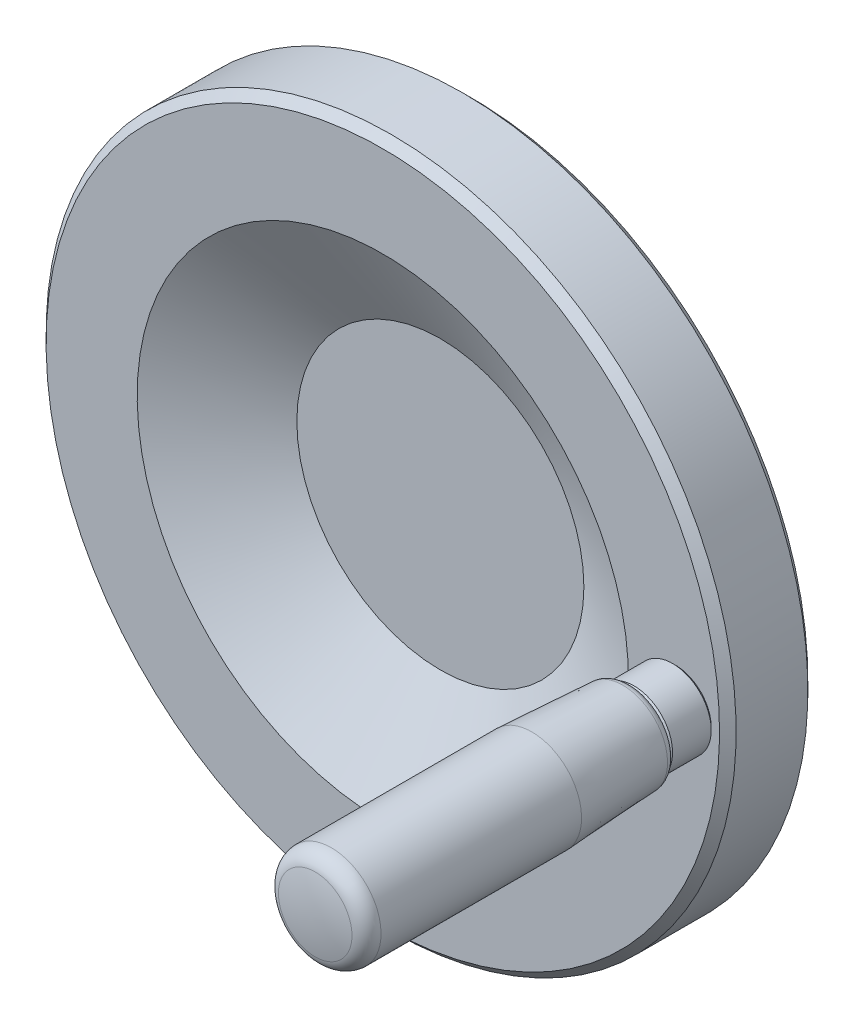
ISO-10303-21;
HEADER;
FILE_DESCRIPTION(('STEP AP214'),'2;1');
FILE_NAME('part.step','',(''),(''),'','','');
FILE_SCHEMA(('AUTOMOTIVE_DESIGN { 1 0 10303 214 1 1 1 1 }'));
ENDSEC;
DATA;
#1=APPLICATION_CONTEXT('core data for automotive mechanical design processes');
#2=APPLICATION_PROTOCOL_DEFINITION('international standard','automotive_design',2000,#1);
#3=PRODUCT_CONTEXT('',#1,'mechanical');
#4=PRODUCT('Part','Part','',(#3));
#5=PRODUCT_RELATED_PRODUCT_CATEGORY('part','',(#4));
#6=PRODUCT_DEFINITION_FORMATION('','',#4);
#7=PRODUCT_DEFINITION_CONTEXT('part definition',#1,'design');
#8=PRODUCT_DEFINITION('design','',#6,#7);
#9=PRODUCT_DEFINITION_SHAPE('','',#8);
#10=(LENGTH_UNIT() NAMED_UNIT(*) SI_UNIT(.MILLI.,.METRE.));
#11=(NAMED_UNIT(*) PLANE_ANGLE_UNIT() SI_UNIT($,.RADIAN.));
#12=(NAMED_UNIT(*) SI_UNIT($,.STERADIAN.) SOLID_ANGLE_UNIT());
#13=UNCERTAINTY_MEASURE_WITH_UNIT(LENGTH_MEASURE(1.E-05),#10,'distance_accuracy_value','');
#14=(GEOMETRIC_REPRESENTATION_CONTEXT(3) GLOBAL_UNCERTAINTY_ASSIGNED_CONTEXT((#13)) GLOBAL_UNIT_ASSIGNED_CONTEXT((#10,
#11,#12)) REPRESENTATION_CONTEXT('',''));
#15=CARTESIAN_POINT('',(0.,0.,0.));
#16=DIRECTION('',(0.,0.,1.));
#17=DIRECTION('',(1.,0.,0.));
#18=AXIS2_PLACEMENT_3D('',#15,#16,#17);
#19=CARTESIAN_POINT('',(0.,0.,43.5));
#20=DIRECTION('',(0.,0.,-1.));
#21=DIRECTION('',(0.,1.,0.));
#22=AXIS2_PLACEMENT_3D('',#19,#20,#21);
#23=CONICAL_SURFACE('',#22,62.5,0.785398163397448);
#24=CARTESIAN_POINT('',(0.,0.,45.));
#25=DIRECTION('',(0.,0.,1.));
#26=DIRECTION('',(0.,-1.,0.));
#27=AXIS2_PLACEMENT_3D('',#24,#25,#26);
#28=CIRCLE('',#27,61.);
#29=CARTESIAN_POINT('',(0.,-61.,45.));
#30=VERTEX_POINT('',#29);
#31=EDGE_CURVE('E16',#30,#30,#28,.T.);
#32=ORIENTED_EDGE('',*,*,#31,.F.);
#33=EDGE_LOOP('',(#32));
#34=FACE_BOUND('',#33,.T.);
#35=CARTESIAN_POINT('',(0.,0.,43.5));
#36=DIRECTION('',(0.,0.,1.));
#37=DIRECTION('',(0.,-1.,0.));
#38=AXIS2_PLACEMENT_3D('',#35,#36,#37);
#39=CIRCLE('',#38,62.5);
#40=CARTESIAN_POINT('',(0.,-62.5,43.5));
#41=VERTEX_POINT('',#40);
#42=EDGE_CURVE('E32',#41,#41,#39,.T.);
#43=ORIENTED_EDGE('',*,*,#42,.T.);
#44=EDGE_LOOP('',(#43));
#45=FACE_BOUND('',#44,.T.);
#46=ADVANCED_FACE('F13',(#34,#45),#23,.T.);
#47=CARTESIAN_POINT('',(44.5,0.,45.));
#48=DIRECTION('',(0.,0.,1.));
#49=DIRECTION('',(0.,-1.,0.));
#50=AXIS2_PLACEMENT_3D('',#47,#48,#49);
#51=PLANE('',#50);
#52=CARTESIAN_POINT('',(53.,0.,45.));
#53=DIRECTION('',(0.,0.,1.));
#54=DIRECTION('',(0.,-1.,0.));
#55=AXIS2_PLACEMENT_3D('',#52,#53,#54);
#56=CIRCLE('',#55,6.48352870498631);
#57=CARTESIAN_POINT('',(53.,-6.48352870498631,45.));
#58=VERTEX_POINT('',#57);
#59=EDGE_CURVE('E8',#58,#58,#56,.T.);
#60=ORIENTED_EDGE('',*,*,#59,.F.);
#61=EDGE_LOOP('',(#60));
#62=FACE_BOUND('',#61,.T.);
#63=ORIENTED_EDGE('',*,*,#31,.T.);
#64=EDGE_LOOP('',(#63));
#65=FACE_BOUND('',#64,.T.);
#66=CARTESIAN_POINT('',(0.,0.,45.));
#67=DIRECTION('',(0.,0.,1.));
#68=DIRECTION('',(0.,-1.,0.));
#69=AXIS2_PLACEMENT_3D('',#66,#67,#68);
#70=CIRCLE('',#69,44.5);
#71=CARTESIAN_POINT('',(0.,-44.5,45.));
#72=VERTEX_POINT('',#71);
#73=EDGE_CURVE('E27',#72,#72,#70,.T.);
#74=ORIENTED_EDGE('',*,*,#73,.F.);
#75=EDGE_LOOP('',(#74));
#76=FACE_BOUND('',#75,.T.);
#77=ADVANCED_FACE('F81',(#62,#65,#76),#51,.T.);
#78=CARTESIAN_POINT('',(0.,0.,45.));
#79=DIRECTION('',(0.,0.,1.));
#80=DIRECTION('',(0.,-1.,0.));
#81=AXIS2_PLACEMENT_3D('',#78,#79,#80);
#82=CONICAL_SURFACE('',#81,44.5,1.05777048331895);
#83=CARTESIAN_POINT('',(0.,0.,34.578246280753));
#84=DIRECTION('',(0.,0.,1.));
#85=DIRECTION('',(0.,-1.,0.));
#86=AXIS2_PLACEMENT_3D('',#83,#84,#85);
#87=CIRCLE('',#86,26.);
#88=CARTESIAN_POINT('',(0.,-26.,34.578246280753));
#89=VERTEX_POINT('',#88);
#90=EDGE_CURVE('E72',#89,#89,#87,.T.);
#91=ORIENTED_EDGE('',*,*,#90,.F.);
#92=EDGE_LOOP('',(#91));
#93=FACE_BOUND('',#92,.T.);
#94=ORIENTED_EDGE('',*,*,#73,.T.);
#95=EDGE_LOOP('',(#94));
#96=FACE_BOUND('',#95,.T.);
#97=ADVANCED_FACE('F79',(#93,#96),#82,.F.);
#98=CARTESIAN_POINT('',(0.,0.,34.578246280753));
#99=DIRECTION('',(0.,0.,1.));
#100=DIRECTION('',(0.,-1.,0.));
#101=AXIS2_PLACEMENT_3D('',#98,#99,#100);
#102=PLANE('',#101);
#103=ORIENTED_EDGE('',*,*,#90,.T.);
#104=EDGE_LOOP('',(#103));
#105=FACE_BOUND('',#104,.T.);
#106=ADVANCED_FACE('F90',(#105),#102,.T.);
#107=CARTESIAN_POINT('',(13.5,0.,0.));
#108=DIRECTION('',(0.,0.,-1.));
#109=DIRECTION('',(0.,1.,0.));
#110=AXIS2_PLACEMENT_3D('',#107,#108,#109);
#111=PLANE('',#110);
#112=CARTESIAN_POINT('',(0.,0.,0.));
#113=DIRECTION('',(0.,0.,1.));
#114=DIRECTION('',(0.,-1.,0.));
#115=AXIS2_PLACEMENT_3D('',#112,#113,#114);
#116=CIRCLE('',#115,13.5);
#117=CARTESIAN_POINT('',(0.,-13.5,0.));
#118=VERTEX_POINT('',#117);
#119=EDGE_CURVE('E68',#118,#118,#116,.T.);
#120=ORIENTED_EDGE('',*,*,#119,.F.);
#121=EDGE_LOOP('',(#120));
#122=FACE_BOUND('',#121,.T.);
#123=ADVANCED_FACE('F98',(#122),#111,.T.);
#124=CARTESIAN_POINT('',(0.,0.,1.));
#125=DIRECTION('',(0.,0.,1.));
#126=DIRECTION('',(0.,-1.,0.));
#127=AXIS2_PLACEMENT_3D('',#124,#125,#126);
#128=CONICAL_SURFACE('',#127,14.5,0.785398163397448);
#129=ORIENTED_EDGE('',*,*,#119,.T.);
#130=EDGE_LOOP('',(#129));
#131=FACE_BOUND('',#130,.T.);
#132=CARTESIAN_POINT('',(0.,0.,1.));
#133=DIRECTION('',(0.,0.,1.));
#134=DIRECTION('',(0.,-1.,0.));
#135=AXIS2_PLACEMENT_3D('',#132,#133,#134);
#136=CIRCLE('',#135,14.5);
#137=CARTESIAN_POINT('',(0.,-14.5,1.));
#138=VERTEX_POINT('',#137);
#139=EDGE_CURVE('E64',#138,#138,#136,.T.);
#140=ORIENTED_EDGE('',*,*,#139,.F.);
#141=EDGE_LOOP('',(#140));
#142=FACE_BOUND('',#141,.T.);
#143=ADVANCED_FACE('F102',(#131,#142),#128,.T.);
#144=CARTESIAN_POINT('',(0.,0.,55.));
#145=DIRECTION('',(0.,0.,1.));
#146=DIRECTION('',(0.,-1.,0.));
#147=AXIS2_PLACEMENT_3D('',#144,#145,#146);
#148=CYLINDRICAL_SURFACE('',#147,14.5);
#149=CARTESIAN_POINT('',(0.,0.,12.));
#150=DIRECTION('',(0.,0.,1.));
#151=DIRECTION('',(0.,-1.,0.));
#152=AXIS2_PLACEMENT_3D('',#149,#150,#151);
#153=CIRCLE('',#152,14.5);
#154=CARTESIAN_POINT('',(0.,-14.5,12.));
#155=VERTEX_POINT('',#154);
#156=EDGE_CURVE('E60',#155,#155,#153,.T.);
#157=ORIENTED_EDGE('',*,*,#156,.F.);
#158=EDGE_LOOP('',(#157));
#159=FACE_BOUND('',#158,.T.);
#160=ORIENTED_EDGE('',*,*,#139,.T.);
#161=EDGE_LOOP('',(#160));
#162=FACE_BOUND('',#161,.T.);
#163=ADVANCED_FACE('F106',(#159,#162),#148,.T.);
#164=CARTESIAN_POINT('',(14.5,0.,12.));
#165=DIRECTION('',(0.,0.,1.));
#166=DIRECTION('',(0.,-1.,0.));
#167=AXIS2_PLACEMENT_3D('',#164,#165,#166);
#168=PLANE('',#167);
#169=CARTESIAN_POINT('',(0.,0.,12.));
#170=DIRECTION('',(0.,0.,1.));
#171=DIRECTION('',(0.,-1.,0.));
#172=AXIS2_PLACEMENT_3D('',#169,#170,#171);
#173=CIRCLE('',#172,19.);
#174=CARTESIAN_POINT('',(0.,-19.,12.));
#175=VERTEX_POINT('',#174);
#176=EDGE_CURVE('E56',#175,#175,#173,.T.);
#177=ORIENTED_EDGE('',*,*,#176,.F.);
#178=EDGE_LOOP('',(#177));
#179=FACE_BOUND('',#178,.T.);
#180=ORIENTED_EDGE('',*,*,#156,.T.);
#181=EDGE_LOOP('',(#180));
#182=FACE_BOUND('',#181,.T.);
#183=ADVANCED_FACE('F110',(#179,#182),#168,.F.);
#184=CARTESIAN_POINT('',(0.,0.,55.));
#185=DIRECTION('',(0.,0.,1.));
#186=DIRECTION('',(0.,-1.,0.));
#187=AXIS2_PLACEMENT_3D('',#184,#185,#186);
#188=CYLINDRICAL_SURFACE('',#187,19.);
#189=CARTESIAN_POINT('',(0.,0.,17.186250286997));
#190=DIRECTION('',(0.,0.,1.));
#191=DIRECTION('',(0.,-1.,0.));
#192=AXIS2_PLACEMENT_3D('',#189,#190,#191);
#193=CIRCLE('',#192,19.);
#194=CARTESIAN_POINT('',(0.,-19.,17.186250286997));
#195=VERTEX_POINT('',#194);
#196=EDGE_CURVE('E52',#195,#195,#193,.T.);
#197=ORIENTED_EDGE('',*,*,#196,.F.);
#198=EDGE_LOOP('',(#197));
#199=FACE_BOUND('',#198,.T.);
#200=ORIENTED_EDGE('',*,*,#176,.T.);
#201=EDGE_LOOP('',(#200));
#202=FACE_BOUND('',#201,.T.);
#203=ADVANCED_FACE('F114',(#199,#202),#188,.T.);
#204=CARTESIAN_POINT('',(0.,0.,17.186250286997));
#205=DIRECTION('',(0.,0.,1.));
#206=DIRECTION('',(0.,-1.,0.));
#207=AXIS2_PLACEMENT_3D('',#204,#205,#206);
#208=TOROIDAL_SURFACE('',#207,23.,4.);
#209=ORIENTED_EDGE('',*,*,#196,.T.);
#210=EDGE_LOOP('',(#209));
#211=FACE_BOUND('',#210,.T.);
#212=CARTESIAN_POINT('',(0.,0.,20.494553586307));
#213=DIRECTION('',(0.,0.,1.));
#214=DIRECTION('',(0.,-1.,0.));
#215=AXIS2_PLACEMENT_3D('',#212,#213,#214);
#216=CIRCLE('',#215,20.7516385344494);
#217=CARTESIAN_POINT('',(0.,-20.7516385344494,20.494553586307));
#218=VERTEX_POINT('',#217);
#219=EDGE_CURVE('E48',#218,#218,#216,.T.);
#220=ORIENTED_EDGE('',*,*,#219,.F.);
#221=EDGE_LOOP('',(#220));
#222=FACE_BOUND('',#221,.T.);
#223=ADVANCED_FACE('F118',(#211,#222),#208,.F.);
#224=CARTESIAN_POINT('',(0.,0.,29.));
#225=DIRECTION('',(0.,0.,1.));
#226=DIRECTION('',(0.,-1.,0.));
#227=AXIS2_PLACEMENT_3D('',#224,#225,#226);
#228=CONICAL_SURFACE('',#227,33.2667954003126,0.973885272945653);
#229=ORIENTED_EDGE('',*,*,#219,.T.);
#230=EDGE_LOOP('',(#229));
#231=FACE_BOUND('',#230,.T.);
#232=CARTESIAN_POINT('',(0.,0.,29.));
#233=DIRECTION('',(0.,0.,1.));
#234=DIRECTION('',(0.,-1.,0.));
#235=AXIS2_PLACEMENT_3D('',#232,#233,#234);
#236=CIRCLE('',#235,33.2667954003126);
#237=CARTESIAN_POINT('',(0.,-33.2667954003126,29.));
#238=VERTEX_POINT('',#237);
#239=EDGE_CURVE('E44',#238,#238,#236,.T.);
#240=ORIENTED_EDGE('',*,*,#239,.F.);
#241=EDGE_LOOP('',(#240));
#242=FACE_BOUND('',#241,.T.);
#243=ADVANCED_FACE('F122',(#231,#242),#228,.T.);
#244=CARTESIAN_POINT('',(61.,0.,29.));
#245=DIRECTION('',(0.,0.,-1.));
#246=DIRECTION('',(0.,1.,0.));
#247=AXIS2_PLACEMENT_3D('',#244,#245,#246);
#248=PLANE('',#247);
#249=ORIENTED_EDGE('',*,*,#239,.T.);
#250=EDGE_LOOP('',(#249));
#251=FACE_BOUND('',#250,.T.);
#252=CARTESIAN_POINT('',(0.,0.,29.));
#253=DIRECTION('',(0.,0.,1.));
#254=DIRECTION('',(0.,-1.,0.));
#255=AXIS2_PLACEMENT_3D('',#252,#253,#254);
#256=CIRCLE('',#255,61.);
#257=CARTESIAN_POINT('',(0.,-61.,29.));
#258=VERTEX_POINT('',#257);
#259=EDGE_CURVE('E40',#258,#258,#256,.T.);
#260=ORIENTED_EDGE('',*,*,#259,.F.);
#261=EDGE_LOOP('',(#260));
#262=FACE_BOUND('',#261,.T.);
#263=ADVANCED_FACE('F126',(#251,#262),#248,.T.);
#264=CARTESIAN_POINT('',(0.,0.,30.5));
#265=DIRECTION('',(0.,0.,1.));
#266=DIRECTION('',(0.,-1.,0.));
#267=AXIS2_PLACEMENT_3D('',#264,#265,#266);
#268=CONICAL_SURFACE('',#267,62.5,0.785398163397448);
#269=ORIENTED_EDGE('',*,*,#259,.T.);
#270=EDGE_LOOP('',(#269));
#271=FACE_BOUND('',#270,.T.);
#272=CARTESIAN_POINT('',(0.,0.,30.5));
#273=DIRECTION('',(0.,0.,1.));
#274=DIRECTION('',(0.,-1.,0.));
#275=AXIS2_PLACEMENT_3D('',#272,#273,#274);
#276=CIRCLE('',#275,62.5);
#277=CARTESIAN_POINT('',(0.,-62.5,30.5));
#278=VERTEX_POINT('',#277);
#279=EDGE_CURVE('E36',#278,#278,#276,.T.);
#280=ORIENTED_EDGE('',*,*,#279,.F.);
#281=EDGE_LOOP('',(#280));
#282=FACE_BOUND('',#281,.T.);
#283=ADVANCED_FACE('F130',(#271,#282),#268,.T.);
#284=CARTESIAN_POINT('',(0.,0.,55.));
#285=DIRECTION('',(0.,0.,1.));
#286=DIRECTION('',(0.,-1.,0.));
#287=AXIS2_PLACEMENT_3D('',#284,#285,#286);
#288=CYLINDRICAL_SURFACE('',#287,62.5);
#289=ORIENTED_EDGE('',*,*,#279,.T.);
#290=EDGE_LOOP('',(#289));
#291=FACE_BOUND('',#290,.T.);
#292=ORIENTED_EDGE('',*,*,#42,.F.);
#293=EDGE_LOOP('',(#292));
#294=FACE_BOUND('',#293,.T.);
#295=ADVANCED_FACE('F134',(#291,#294),#288,.T.);
#296=CARTESIAN_POINT('',(53.,0.,81.));
#297=DIRECTION('',(0.,-1.,0.));
#298=DIRECTION('',(0.,0.,-1.));
#299=AXIS2_PLACEMENT_3D('',#296,#297,#298);
#300=SPHERICAL_SURFACE('',#299,30.);
#301=CARTESIAN_POINT('',(53.,0.,81.));
#302=DIRECTION('',(0.,0.,1.));
#303=DIRECTION('',(0.,-1.,0.));
#304=AXIS2_PLACEMENT_3D('',#301,#302,#303);
#305=SPHERICAL_SURFACE('',#304,30.);
#306=CARTESIAN_POINT('',(53.,0.,110.249881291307));
#307=DIRECTION('',(0.,0.,1.));
#308=DIRECTION('',(0.,-1.,0.));
#309=AXIS2_PLACEMENT_3D('',#306,#307,#308);
#310=CIRCLE('',#309,6.66666666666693);
#311=CARTESIAN_POINT('',(53.,-6.66666666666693,110.249881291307));
#312=VERTEX_POINT('',#311);
#313=EDGE_CURVE('E179',#312,#312,#310,.T.);
#314=ORIENTED_EDGE('',*,*,#313,.T.);
#315=EDGE_LOOP('',(#314));
#316=FACE_BOUND('',#315,.T.);
#317=ADVANCED_FACE('F138',(#316),#305,.T.);
#318=CARTESIAN_POINT('',(53.,0.,45.5));
#319=DIRECTION('',(0.,0.,1.));
#320=DIRECTION('',(0.,-1.,0.));
#321=AXIS2_PLACEMENT_3D('',#318,#319,#320);
#322=CONICAL_SURFACE('',#321,6.98352870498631,0.785398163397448);
#323=ORIENTED_EDGE('',*,*,#59,.T.);
#324=EDGE_LOOP('',(#323));
#325=FACE_BOUND('',#324,.T.);
#326=CARTESIAN_POINT('',(53.,0.,45.5));
#327=DIRECTION('',(0.,0.,1.));
#328=DIRECTION('',(0.,-1.,0.));
#329=AXIS2_PLACEMENT_3D('',#326,#327,#328);
#330=CIRCLE('',#329,6.98352870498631);
#331=CARTESIAN_POINT('',(53.,-6.98352870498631,45.5));
#332=VERTEX_POINT('',#331);
#333=EDGE_CURVE('E30',#332,#332,#330,.T.);
#334=ORIENTED_EDGE('',*,*,#333,.F.);
#335=EDGE_LOOP('',(#334));
#336=FACE_BOUND('',#335,.T.);
#337=ADVANCED_FACE('F142',(#325,#336),#322,.T.);
#338=CARTESIAN_POINT('',(53.,0.,116.));
#339=DIRECTION('',(0.,0.,1.));
#340=DIRECTION('',(0.,-1.,0.));
#341=AXIS2_PLACEMENT_3D('',#338,#339,#340);
#342=CYLINDRICAL_SURFACE('',#341,6.98352870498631);
#343=CARTESIAN_POINT('',(53.,0.,52.5));
#344=DIRECTION('',(0.,0.,1.));
#345=DIRECTION('',(0.,-1.,0.));
#346=AXIS2_PLACEMENT_3D('',#343,#344,#345);
#347=CIRCLE('',#346,6.98352870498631);
#348=CARTESIAN_POINT('',(53.,-6.98352870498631,52.5));
#349=VERTEX_POINT('',#348);
#350=EDGE_CURVE('E204',#349,#349,#347,.T.);
#351=ORIENTED_EDGE('',*,*,#350,.F.);
#352=EDGE_LOOP('',(#351));
#353=FACE_BOUND('',#352,.T.);
#354=ORIENTED_EDGE('',*,*,#333,.T.);
#355=EDGE_LOOP('',(#354));
#356=FACE_BOUND('',#355,.T.);
#357=ADVANCED_FACE('F146',(#353,#356),#342,.T.);
#358=CARTESIAN_POINT('',(53.,0.,52.5));
#359=DIRECTION('',(0.,0.,-1.));
#360=DIRECTION('',(0.,1.,0.));
#361=AXIS2_PLACEMENT_3D('',#358,#359,#360);
#362=CONICAL_SURFACE('',#361,6.98352870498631,0.785398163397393);
#363=CARTESIAN_POINT('',(53.,0.,53.));
#364=DIRECTION('',(0.,0.,1.));
#365=DIRECTION('',(0.,-1.,0.));
#366=AXIS2_PLACEMENT_3D('',#363,#364,#365);
#367=CIRCLE('',#366,6.48352870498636);
#368=CARTESIAN_POINT('',(53.,-6.48352870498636,53.));
#369=VERTEX_POINT('',#368);
#370=EDGE_CURVE('E201',#369,#369,#367,.T.);
#371=ORIENTED_EDGE('',*,*,#370,.F.);
#372=EDGE_LOOP('',(#371));
#373=FACE_BOUND('',#372,.T.);
#374=ORIENTED_EDGE('',*,*,#350,.T.);
#375=EDGE_LOOP('',(#374));
#376=FACE_BOUND('',#375,.T.);
#377=ADVANCED_FACE('F149',(#373,#376),#362,.T.);
#378=CARTESIAN_POINT('',(59.4864216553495,0.,53.));
#379=DIRECTION('',(0.,0.,-1.));
#380=DIRECTION('',(0.,1.,0.));
#381=AXIS2_PLACEMENT_3D('',#378,#379,#380);
#382=PLANE('',#381);
#383=ORIENTED_EDGE('',*,*,#370,.T.);
#384=EDGE_LOOP('',(#383));
#385=FACE_BOUND('',#384,.T.);
#386=CARTESIAN_POINT('',(53.,0.,53.));
#387=DIRECTION('',(0.,0.,1.));
#388=DIRECTION('',(0.,-1.,0.));
#389=AXIS2_PLACEMENT_3D('',#386,#387,#388);
#390=CIRCLE('',#389,6.48642165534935);
#391=CARTESIAN_POINT('',(53.,-6.48642165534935,53.));
#392=VERTEX_POINT('',#391);
#393=EDGE_CURVE('E197',#392,#392,#390,.T.);
#394=ORIENTED_EDGE('',*,*,#393,.F.);
#395=EDGE_LOOP('',(#394));
#396=FACE_BOUND('',#395,.T.);
#397=ADVANCED_FACE('F153',(#385,#396),#382,.T.);
#398=CARTESIAN_POINT('',(53.,0.,54.6));
#399=DIRECTION('',(0.,0.,1.));
#400=DIRECTION('',(0.,-1.,0.));
#401=AXIS2_PLACEMENT_3D('',#398,#399,#400);
#402=TOROIDAL_SURFACE('',#401,6.48642165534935,1.60000000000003);
#403=CARTESIAN_POINT('',(53.,0.,54.511247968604));
#404=DIRECTION('',(0.,0.,1.));
#405=DIRECTION('',(0.,-1.,0.));
#406=AXIS2_PLACEMENT_3D('',#403,#404,#405);
#407=CIRCLE('',#406,8.08395822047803);
#408=CARTESIAN_POINT('',(53.,-8.08395822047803,54.511247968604));
#409=VERTEX_POINT('',#408);
#410=EDGE_CURVE('E190',#409,#409,#407,.T.);
#411=ORIENTED_EDGE('',*,*,#410,.F.);
#412=EDGE_LOOP('',(#411));
#413=FACE_BOUND('',#412,.T.);
#414=ORIENTED_EDGE('',*,*,#393,.T.);
#415=EDGE_LOOP('',(#414));
#416=FACE_BOUND('',#415,.T.);
#417=ADVANCED_FACE('F157',(#413,#416),#402,.T.);
#418=CARTESIAN_POINT('',(53.,0.,71.));
#419=DIRECTION('',(0.,0.,1.));
#420=DIRECTION('',(0.,-1.,0.));
#421=AXIS2_PLACEMENT_3D('',#418,#419,#420);
#422=CONICAL_SURFACE('',#421,9.00000000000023,0.0554985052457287);
#423=ORIENTED_EDGE('',*,*,#410,.T.);
#424=EDGE_LOOP('',(#423));
#425=FACE_BOUND('',#424,.T.);
#426=CARTESIAN_POINT('',(53.,0.,71.));
#427=DIRECTION('',(0.,0.,1.));
#428=DIRECTION('',(0.,-1.,0.));
#429=AXIS2_PLACEMENT_3D('',#426,#427,#428);
#430=CIRCLE('',#429,9.00000000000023);
#431=CARTESIAN_POINT('',(53.,-9.00000000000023,71.));
#432=VERTEX_POINT('',#431);
#433=EDGE_CURVE('E185',#432,#432,#430,.T.);
#434=ORIENTED_EDGE('',*,*,#433,.F.);
#435=EDGE_LOOP('',(#434));
#436=FACE_BOUND('',#435,.T.);
#437=ADVANCED_FACE('F161',(#425,#436),#422,.T.);
#438=CARTESIAN_POINT('',(53.,0.,116.));
#439=DIRECTION('',(0.,0.,1.));
#440=DIRECTION('',(0.,-1.,0.));
#441=AXIS2_PLACEMENT_3D('',#438,#439,#440);
#442=CYLINDRICAL_SURFACE('',#441,9.00000000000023);
#443=ORIENTED_EDGE('',*,*,#433,.T.);
#444=EDGE_LOOP('',(#443));
#445=FACE_BOUND('',#444,.T.);
#446=CARTESIAN_POINT('',(53.,0.,107.324893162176));
#447=DIRECTION('',(0.,0.,1.));
#448=DIRECTION('',(0.,-1.,0.));
#449=AXIS2_PLACEMENT_3D('',#446,#447,#448);
#450=CIRCLE('',#449,9.00000000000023);
#451=CARTESIAN_POINT('',(53.,-9.00000000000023,107.324893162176));
#452=VERTEX_POINT('',#451);
#453=EDGE_CURVE('E182',#452,#452,#450,.T.);
#454=ORIENTED_EDGE('',*,*,#453,.F.);
#455=EDGE_LOOP('',(#454));
#456=FACE_BOUND('',#455,.T.);
#457=ADVANCED_FACE('F165',(#445,#456),#442,.T.);
#458=CARTESIAN_POINT('',(53.,0.,107.324893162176));
#459=DIRECTION('',(0.,0.,1.));
#460=DIRECTION('',(0.,-1.,0.));
#461=AXIS2_PLACEMENT_3D('',#458,#459,#460);
#462=TOROIDAL_SURFACE('',#461,6.00000000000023,3.);
#463=ORIENTED_EDGE('',*,*,#313,.F.);
#464=EDGE_LOOP('',(#463));
#465=FACE_BOUND('',#464,.T.);
#466=ORIENTED_EDGE('',*,*,#453,.T.);
#467=EDGE_LOOP('',(#466));
#468=FACE_BOUND('',#467,.T.);
#469=ADVANCED_FACE('F169',(#465,#468),#462,.T.);
#470=CLOSED_SHELL('',(#46,#77,#97,#106,#123,#143,#163,#183,#203,#223,#243,#263,#283,#295,#317,
#337,#357,#377,#397,#417,#437,#457,#469));
#471=MANIFOLD_SOLID_BREP('B1',#470);
#472=ADVANCED_BREP_SHAPE_REPRESENTATION('',(#18,#471),#14);
#473=SHAPE_DEFINITION_REPRESENTATION(#9,#472);
ENDSEC;
END-ISO-10303-21;
